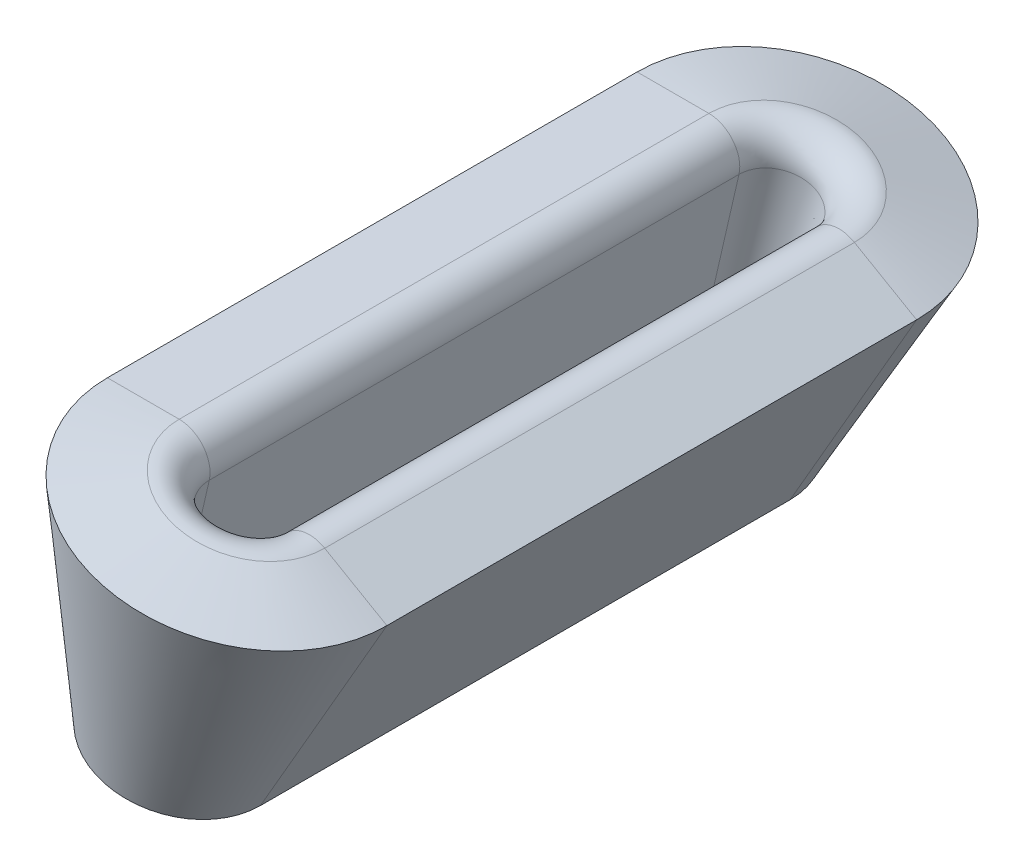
ISO-10303-21;
HEADER;
FILE_DESCRIPTION(('STEP AP214'),'2;1');
FILE_NAME('part.step','',(''),(''),'','','');
FILE_SCHEMA(('AUTOMOTIVE_DESIGN { 1 0 10303 214 1 1 1 1 }'));
ENDSEC;
DATA;
#1=APPLICATION_CONTEXT('core data for automotive mechanical design processes');
#2=APPLICATION_PROTOCOL_DEFINITION('international standard','automotive_design',2000,#1);
#3=PRODUCT_CONTEXT('',#1,'mechanical');
#4=PRODUCT('Part','Part','',(#3));
#5=PRODUCT_RELATED_PRODUCT_CATEGORY('part','',(#4));
#6=PRODUCT_DEFINITION_FORMATION('','',#4);
#7=PRODUCT_DEFINITION_CONTEXT('part definition',#1,'design');
#8=PRODUCT_DEFINITION('design','',#6,#7);
#9=PRODUCT_DEFINITION_SHAPE('','',#8);
#10=(LENGTH_UNIT() NAMED_UNIT(*) SI_UNIT(.MILLI.,.METRE.));
#11=(NAMED_UNIT(*) PLANE_ANGLE_UNIT() SI_UNIT($,.RADIAN.));
#12=(NAMED_UNIT(*) SI_UNIT($,.STERADIAN.) SOLID_ANGLE_UNIT());
#13=UNCERTAINTY_MEASURE_WITH_UNIT(LENGTH_MEASURE(1.E-05),#10,'distance_accuracy_value','');
#14=(GEOMETRIC_REPRESENTATION_CONTEXT(3) GLOBAL_UNCERTAINTY_ASSIGNED_CONTEXT((#13)) GLOBAL_UNIT_ASSIGNED_CONTEXT((#10,
#11,#12)) REPRESENTATION_CONTEXT('',''));
#15=CARTESIAN_POINT('',(0.,0.,0.));
#16=DIRECTION('',(0.,0.,1.));
#17=DIRECTION('',(1.,0.,0.));
#18=AXIS2_PLACEMENT_3D('',#15,#16,#17);
#19=CARTESIAN_POINT('',(13.5884499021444,51.8324006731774,0.));
#20=DIRECTION('',(0.258819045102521,0.965925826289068,0.));
#21=DIRECTION('',(-0.965925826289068,0.258819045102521,0.));
#22=AXIS2_PLACEMENT_3D('',#19,#20,#21);
#23=CONICAL_SURFACE('',#22,14.0677985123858,0.261799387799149);
#24=CARTESIAN_POINT('',(13.5884499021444,51.8324006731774,0.));
#25=DIRECTION('',(0.258819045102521,0.965925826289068,0.));
#26=DIRECTION('',(-0.965925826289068,0.258819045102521,0.));
#27=AXIS2_PLACEMENT_3D('',#24,#25,#26);
#28=CIRCLE('',#27,14.0677985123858);
#29=CARTESIAN_POINT('',(27.1768998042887,48.191386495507,0.));
#30=VERTEX_POINT('',#29);
#31=CARTESIAN_POINT('',(0.,55.4734148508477,0.));
#32=VERTEX_POINT('',#31);
#33=EDGE_CURVE('E11',#30,#32,#28,.T.);
#34=ORIENTED_EDGE('',*,*,#33,.F.);
#35=DIRECTION('',(-0.5,-0.866025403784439,0.));
#36=VECTOR('',#35,1.);
#37=CARTESIAN_POINT('',(14.8768998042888,26.8871615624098,0.));
#38=LINE('',#37,#36);
#39=CARTESIAN_POINT('',(14.8768998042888,26.8871615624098,0.));
#40=VERTEX_POINT('',#39);
#41=EDGE_CURVE('E196',#30,#40,#38,.T.);
#42=ORIENTED_EDGE('',*,*,#41,.T.);
#43=CARTESIAN_POINT('',(7.43844990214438,28.8802882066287,0.));
#44=DIRECTION('',(0.258819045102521,0.965925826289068,0.));
#45=DIRECTION('',(-0.965925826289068,0.258819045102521,0.));
#46=AXIS2_PLACEMENT_3D('',#43,#44,#45);
#47=CIRCLE('',#46,7.70085000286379);
#48=CARTESIAN_POINT('',(0.,30.8734148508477,0.));
#49=VERTEX_POINT('',#48);
#50=EDGE_CURVE('E214',#40,#49,#47,.T.);
#51=ORIENTED_EDGE('',*,*,#50,.T.);
#52=DIRECTION('',(0.,-1.,0.));
#53=VECTOR('',#52,1.);
#54=CARTESIAN_POINT('',(0.,30.8734148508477,0.));
#55=LINE('',#54,#53);
#56=EDGE_CURVE('E179',#32,#49,#55,.T.);
#57=ORIENTED_EDGE('',*,*,#56,.F.);
#58=EDGE_LOOP('',(#34,#42,#51,#57));
#59=FACE_BOUND('',#58,.T.);
#60=ADVANCED_FACE('F39',(#59),#23,.T.);
#61=CARTESIAN_POINT('',(14.0562132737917,53.5781173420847,0.));
#62=DIRECTION('',(-0.258819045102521,-0.965925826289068,0.));
#63=DIRECTION('',(0.965925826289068,-0.258819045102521,0.));
#64=AXIS2_PLACEMENT_3D('',#61,#62,#63);
#65=CONICAL_SURFACE('',#64,7.32286724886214,1.30899693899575);
#66=CARTESIAN_POINT('',(14.0562132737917,53.5781173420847,0.));
#67=DIRECTION('',(0.258819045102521,0.965925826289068,0.));
#68=DIRECTION('',(-0.965925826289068,0.258819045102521,0.));
#69=AXIS2_PLACEMENT_3D('',#66,#67,#68);
#70=CIRCLE('',#69,7.32286724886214);
#71=CARTESIAN_POINT('',(21.1295598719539,51.6828198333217,0.));
#72=VERTEX_POINT('',#71);
#73=CARTESIAN_POINT('',(6.98286667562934,55.4734148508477,0.));
#74=VERTEX_POINT('',#73);
#75=EDGE_CURVE('E48',#72,#74,#70,.T.);
#76=ORIENTED_EDGE('',*,*,#75,.F.);
#77=DIRECTION('',(0.866025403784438,-0.500000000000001,0.));
#78=VECTOR('',#77,1.);
#79=CARTESIAN_POINT('',(21.129559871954,51.6828198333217,0.));
#80=LINE('',#79,#78);
#81=EDGE_CURVE('E211',#72,#30,#80,.T.);
#82=ORIENTED_EDGE('',*,*,#81,.T.);
#83=ORIENTED_EDGE('',*,*,#33,.T.);
#84=DIRECTION('',(-1.,0.,0.));
#85=VECTOR('',#84,1.);
#86=CARTESIAN_POINT('',(6.98286667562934,55.4734148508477,0.));
#87=LINE('',#86,#85);
#88=EDGE_CURVE('E192',#74,#32,#87,.T.);
#89=ORIENTED_EDGE('',*,*,#88,.F.);
#90=EDGE_LOOP('',(#76,#82,#83,#89));
#91=FACE_BOUND('',#90,.T.);
#92=ADVANCED_FACE('F41',(#91),#65,.T.);
#93=CARTESIAN_POINT('',(13.3062132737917,50.779079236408,0.));
#94=DIRECTION('',(0.258819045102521,0.965925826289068,0.));
#95=DIRECTION('',(-0.965925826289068,0.258819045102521,0.));
#96=AXIS2_PLACEMENT_3D('',#93,#94,#95);
#97=TOROIDAL_SURFACE('',#96,6.54641011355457,3.00000000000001);
#98=CARTESIAN_POINT('',(13.3341906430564,50.8834921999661,0.));
#99=DIRECTION('',(0.258819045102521,0.965925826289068,0.));
#100=DIRECTION('',(-0.965925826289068,0.258819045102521,0.));
#101=AXIS2_PLACEMENT_3D('',#98,#99,#100);
#102=CIRCLE('',#101,3.54835821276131);
#103=CARTESIAN_POINT('',(16.7616414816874,49.9651095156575,0.));
#104=VERTEX_POINT('',#103);
#105=CARTESIAN_POINT('',(9.9067398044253,51.8018748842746,0.));
#106=VERTEX_POINT('',#105);
#107=EDGE_CURVE('E220',#104,#106,#102,.T.);
#108=ORIENTED_EDGE('',*,*,#107,.F.);
#109=CARTESIAN_POINT('',(19.629559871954,49.0847436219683,0.));
#110=DIRECTION('',(0.,0.,-1.));
#111=DIRECTION('',(0.866025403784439,-0.5,0.));
#112=AXIS2_PLACEMENT_3D('',#109,#110,#111);
#113=CIRCLE('',#112,3.00000000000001);
#114=EDGE_CURVE('E208',#104,#72,#113,.T.);
#115=ORIENTED_EDGE('',*,*,#114,.T.);
#116=ORIENTED_EDGE('',*,*,#75,.T.);
#117=CARTESIAN_POINT('',(6.98286667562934,52.4734148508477,0.));
#118=DIRECTION('',(0.,0.,1.));
#119=DIRECTION('',(-1.,0.,0.));
#120=AXIS2_PLACEMENT_3D('',#117,#118,#119);
#121=CIRCLE('',#120,3.00000000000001);
#122=EDGE_CURVE('E189',#106,#74,#121,.T.);
#123=ORIENTED_EDGE('',*,*,#122,.F.);
#124=EDGE_LOOP('',(#108,#115,#116,#123));
#125=FACE_BOUND('',#124,.T.);
#126=ADVANCED_FACE('F228',(#125),#97,.T.);
#127=CARTESIAN_POINT('',(7.78008512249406,30.1552882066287,0.));
#128=DIRECTION('',(0.258819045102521,0.965925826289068,0.));
#129=DIRECTION('',(-0.965925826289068,0.258819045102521,0.));
#130=AXIS2_PLACEMENT_3D('',#127,#128,#129);
#131=CONICAL_SURFACE('',#130,2.77462828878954,0.0360398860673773);
#132=CARTESIAN_POINT('',(7.78008512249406,30.1552882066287,0.));
#133=DIRECTION('',(0.258819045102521,0.965925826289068,0.));
#134=DIRECTION('',(-0.965925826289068,0.258819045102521,0.));
#135=AXIS2_PLACEMENT_3D('',#132,#133,#134);
#136=CIRCLE('',#135,2.77462828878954);
#137=CARTESIAN_POINT('',(10.4601702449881,29.4371615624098,0.));
#138=VERTEX_POINT('',#137);
#139=CARTESIAN_POINT('',(5.1,30.8734148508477,0.));
#140=VERTEX_POINT('',#139);
#141=EDGE_CURVE('E217',#138,#140,#136,.T.);
#142=ORIENTED_EDGE('',*,*,#141,.F.);
#143=DIRECTION('',(0.293455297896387,0.955972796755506,0.));
#144=VECTOR('',#143,1.);
#145=CARTESIAN_POINT('',(10.4601702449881,29.4371615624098,0.));
#146=LINE('',#145,#144);
#147=EDGE_CURVE('E204',#138,#104,#146,.T.);
#148=ORIENTED_EDGE('',*,*,#147,.T.);
#149=ORIENTED_EDGE('',*,*,#107,.T.);
#150=DIRECTION('',(0.223846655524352,0.974624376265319,0.));
#151=VECTOR('',#150,1.);
#152=CARTESIAN_POINT('',(5.1,30.8734148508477,0.));
#153=LINE('',#152,#151);
#154=EDGE_CURVE('E141',#140,#106,#153,.T.);
#155=ORIENTED_EDGE('',*,*,#154,.F.);
#156=EDGE_LOOP('',(#142,#148,#149,#155));
#157=FACE_BOUND('',#156,.T.);
#158=ADVANCED_FACE('F302',(#157),#131,.F.);
#159=CARTESIAN_POINT('',(7.43844990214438,28.8802882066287,0.));
#160=DIRECTION('',(-0.258819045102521,-0.965925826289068,0.));
#161=DIRECTION('',(0.965925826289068,-0.258819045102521,0.));
#162=AXIS2_PLACEMENT_3D('',#159,#160,#161);
#163=CONICAL_SURFACE('',#162,7.70085000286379,1.30899693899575);
#164=DIRECTION('',(-0.866025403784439,0.5,0.));
#165=VECTOR('',#164,1.);
#166=CARTESIAN_POINT('',(10.4601702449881,29.4371615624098,0.));
#167=LINE('',#166,#165);
#168=EDGE_CURVE('E200',#40,#138,#167,.T.);
#169=ORIENTED_EDGE('',*,*,#168,.T.);
#170=ORIENTED_EDGE('',*,*,#141,.T.);
#171=DIRECTION('',(1.,0.,0.));
#172=VECTOR('',#171,1.);
#173=CARTESIAN_POINT('',(5.1,30.8734148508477,0.));
#174=LINE('',#173,#172);
#175=EDGE_CURVE('E183',#49,#140,#174,.T.);
#176=ORIENTED_EDGE('',*,*,#175,.F.);
#177=ORIENTED_EDGE('',*,*,#50,.F.);
#178=EDGE_LOOP('',(#169,#170,#176,#177));
#179=FACE_BOUND('',#178,.T.);
#180=ADVANCED_FACE('F299',(#179),#163,.F.);
#181=CARTESIAN_POINT('',(6.98286667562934,52.4734148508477,51.5));
#182=DIRECTION('',(0.,0.,-1.));
#183=DIRECTION('',(-1.,0.,0.));
#184=AXIS2_PLACEMENT_3D('',#181,#182,#183);
#185=CYLINDRICAL_SURFACE('',#184,3.);
#186=ORIENTED_EDGE('',*,*,#122,.T.);
#187=DIRECTION('',(0.,0.,-1.));
#188=VECTOR('',#187,1.);
#189=CARTESIAN_POINT('',(6.98286667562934,55.4734148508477,51.5));
#190=LINE('',#189,#188);
#191=CARTESIAN_POINT('',(6.98286667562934,55.4734148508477,51.5));
#192=VERTEX_POINT('',#191);
#193=EDGE_CURVE('E122',#192,#74,#190,.T.);
#194=ORIENTED_EDGE('',*,*,#193,.F.);
#195=CARTESIAN_POINT('',(6.98286667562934,52.4734148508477,51.5));
#196=DIRECTION('',(0.,0.,1.));
#197=DIRECTION('',(1.,0.,0.));
#198=AXIS2_PLACEMENT_3D('',#195,#196,#197);
#199=CIRCLE('',#198,3.);
#200=CARTESIAN_POINT('',(9.9067398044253,51.8018748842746,51.5));
#201=VERTEX_POINT('',#200);
#202=EDGE_CURVE('E117',#201,#192,#199,.T.);
#203=ORIENTED_EDGE('',*,*,#202,.F.);
#204=DIRECTION('',(0.,0.,-1.));
#205=VECTOR('',#204,1.);
#206=CARTESIAN_POINT('',(9.9067398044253,51.8018748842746,51.5));
#207=LINE('',#206,#205);
#208=EDGE_CURVE('E120',#201,#106,#207,.T.);
#209=ORIENTED_EDGE('',*,*,#208,.T.);
#210=EDGE_LOOP('',(#186,#194,#203,#209));
#211=FACE_BOUND('',#210,.T.);
#212=ADVANCED_FACE('F119',(#211),#185,.T.);
#213=CARTESIAN_POINT('',(6.98286667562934,55.4734148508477,51.5));
#214=DIRECTION('',(0.,-1.,0.));
#215=DIRECTION('',(1.,0.,0.));
#216=AXIS2_PLACEMENT_3D('',#213,#214,#215);
#217=PLANE('',#216);
#218=ORIENTED_EDGE('',*,*,#88,.T.);
#219=DIRECTION('',(0.,0.,-1.));
#220=VECTOR('',#219,1.);
#221=CARTESIAN_POINT('',(0.,55.4734148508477,51.5));
#222=LINE('',#221,#220);
#223=CARTESIAN_POINT('',(0.,55.4734148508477,51.5));
#224=VERTEX_POINT('',#223);
#225=EDGE_CURVE('E173',#224,#32,#222,.T.);
#226=ORIENTED_EDGE('',*,*,#225,.F.);
#227=DIRECTION('',(-1.,0.,0.));
#228=VECTOR('',#227,1.);
#229=CARTESIAN_POINT('',(6.98286667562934,55.4734148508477,51.5));
#230=LINE('',#229,#228);
#231=EDGE_CURVE('E129',#192,#224,#230,.T.);
#232=ORIENTED_EDGE('',*,*,#231,.F.);
#233=ORIENTED_EDGE('',*,*,#193,.T.);
#234=EDGE_LOOP('',(#218,#226,#232,#233));
#235=FACE_BOUND('',#234,.T.);
#236=ADVANCED_FACE('F231',(#235),#217,.F.);
#237=CARTESIAN_POINT('',(0.,55.4734148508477,51.5));
#238=DIRECTION('',(1.,0.,0.));
#239=DIRECTION('',(0.,0.,-1.));
#240=AXIS2_PLACEMENT_3D('',#237,#238,#239);
#241=PLANE('',#240);
#242=ORIENTED_EDGE('',*,*,#56,.T.);
#243=DIRECTION('',(0.,0.,-1.));
#244=VECTOR('',#243,1.);
#245=CARTESIAN_POINT('',(0.,30.8734148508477,51.5));
#246=LINE('',#245,#244);
#247=CARTESIAN_POINT('',(0.,30.8734148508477,51.5));
#248=VERTEX_POINT('',#247);
#249=EDGE_CURVE('E169',#248,#49,#246,.T.);
#250=ORIENTED_EDGE('',*,*,#249,.F.);
#251=DIRECTION('',(0.,-1.,0.));
#252=VECTOR('',#251,1.);
#253=CARTESIAN_POINT('',(0.,55.4734148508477,51.5));
#254=LINE('',#253,#252);
#255=EDGE_CURVE('E163',#224,#248,#254,.T.);
#256=ORIENTED_EDGE('',*,*,#255,.F.);
#257=ORIENTED_EDGE('',*,*,#225,.T.);
#258=EDGE_LOOP('',(#242,#250,#256,#257));
#259=FACE_BOUND('',#258,.T.);
#260=ADVANCED_FACE('F293',(#259),#241,.F.);
#261=CARTESIAN_POINT('',(0.,30.8734148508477,51.5));
#262=DIRECTION('',(0.,1.,0.));
#263=DIRECTION('',(0.,0.,1.));
#264=AXIS2_PLACEMENT_3D('',#261,#262,#263);
#265=PLANE('',#264);
#266=ORIENTED_EDGE('',*,*,#175,.T.);
#267=DIRECTION('',(0.,0.,-1.));
#268=VECTOR('',#267,1.);
#269=CARTESIAN_POINT('',(5.1,30.8734148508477,51.5));
#270=LINE('',#269,#268);
#271=CARTESIAN_POINT('',(5.1,30.8734148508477,51.5));
#272=VERTEX_POINT('',#271);
#273=EDGE_CURVE('E143',#272,#140,#270,.T.);
#274=ORIENTED_EDGE('',*,*,#273,.F.);
#275=DIRECTION('',(1.,0.,0.));
#276=VECTOR('',#275,1.);
#277=CARTESIAN_POINT('',(0.,30.8734148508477,51.5));
#278=LINE('',#277,#276);
#279=EDGE_CURVE('E160',#248,#272,#278,.T.);
#280=ORIENTED_EDGE('',*,*,#279,.F.);
#281=ORIENTED_EDGE('',*,*,#249,.T.);
#282=EDGE_LOOP('',(#266,#274,#280,#281));
#283=FACE_BOUND('',#282,.T.);
#284=ADVANCED_FACE('F295',(#283),#265,.F.);
#285=CARTESIAN_POINT('',(5.1,30.8734148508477,51.5));
#286=DIRECTION('',(-0.974624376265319,0.223846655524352,0.));
#287=DIRECTION('',(-0.223846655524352,-0.974624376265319,0.));
#288=AXIS2_PLACEMENT_3D('',#285,#286,#287);
#289=PLANE('',#288);
#290=ORIENTED_EDGE('',*,*,#154,.T.);
#291=ORIENTED_EDGE('',*,*,#208,.F.);
#292=DIRECTION('',(0.223846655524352,0.974624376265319,0.));
#293=VECTOR('',#292,1.);
#294=CARTESIAN_POINT('',(5.1,30.8734148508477,51.5));
#295=LINE('',#294,#293);
#296=EDGE_CURVE('E138',#272,#201,#295,.T.);
#297=ORIENTED_EDGE('',*,*,#296,.F.);
#298=ORIENTED_EDGE('',*,*,#273,.T.);
#299=EDGE_LOOP('',(#290,#291,#297,#298));
#300=FACE_BOUND('',#299,.T.);
#301=ADVANCED_FACE('F135',(#300),#289,.F.);
#302=CARTESIAN_POINT('',(27.1768998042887,48.191386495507,51.5));
#303=DIRECTION('',(-0.86602540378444,0.499999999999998,0.));
#304=DIRECTION('',(-0.499999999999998,-0.86602540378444,0.));
#305=AXIS2_PLACEMENT_3D('',#302,#303,#304);
#306=PLANE('',#305);
#307=ORIENTED_EDGE('',*,*,#41,.F.);
#308=DIRECTION('',(0.,0.,-1.));
#309=VECTOR('',#308,1.);
#310=CARTESIAN_POINT('',(27.1768998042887,48.191386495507,51.5));
#311=LINE('',#310,#309);
#312=CARTESIAN_POINT('',(27.1768998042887,48.191386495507,51.5));
#313=VERTEX_POINT('',#312);
#314=EDGE_CURVE('E130',#313,#30,#311,.T.);
#315=ORIENTED_EDGE('',*,*,#314,.F.);
#316=DIRECTION('',(0.499999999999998,0.86602540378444,0.));
#317=VECTOR('',#316,1.);
#318=CARTESIAN_POINT('',(27.1768998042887,48.191386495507,51.5));
#319=LINE('',#318,#317);
#320=CARTESIAN_POINT('',(14.8768998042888,26.8871615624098,51.5));
#321=VERTEX_POINT('',#320);
#322=EDGE_CURVE('E270',#321,#313,#319,.T.);
#323=ORIENTED_EDGE('',*,*,#322,.F.);
#324=DIRECTION('',(0.,0.,-1.));
#325=VECTOR('',#324,1.);
#326=CARTESIAN_POINT('',(14.8768998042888,26.8871615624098,51.5));
#327=LINE('',#326,#325);
#328=EDGE_CURVE('E253',#321,#40,#327,.T.);
#329=ORIENTED_EDGE('',*,*,#328,.T.);
#330=EDGE_LOOP('',(#307,#315,#323,#329));
#331=FACE_BOUND('',#330,.T.);
#332=ADVANCED_FACE('F314',(#331),#306,.F.);
#333=CARTESIAN_POINT('',(21.1295598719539,51.6828198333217,51.5));
#334=DIRECTION('',(-0.499999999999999,-0.866025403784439,0.));
#335=DIRECTION('',(0.866025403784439,-0.499999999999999,0.));
#336=AXIS2_PLACEMENT_3D('',#333,#334,#335);
#337=PLANE('',#336);
#338=ORIENTED_EDGE('',*,*,#81,.F.);
#339=DIRECTION('',(0.,0.,-1.));
#340=VECTOR('',#339,1.);
#341=CARTESIAN_POINT('',(21.1295598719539,51.6828198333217,51.5));
#342=LINE('',#341,#340);
#343=CARTESIAN_POINT('',(21.1295598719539,51.6828198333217,51.5));
#344=VERTEX_POINT('',#343);
#345=EDGE_CURVE('E243',#344,#72,#342,.T.);
#346=ORIENTED_EDGE('',*,*,#345,.F.);
#347=DIRECTION('',(-0.866025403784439,0.499999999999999,0.));
#348=VECTOR('',#347,1.);
#349=CARTESIAN_POINT('',(21.1295598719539,51.6828198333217,51.5));
#350=LINE('',#349,#348);
#351=EDGE_CURVE('E266',#313,#344,#350,.T.);
#352=ORIENTED_EDGE('',*,*,#351,.F.);
#353=ORIENTED_EDGE('',*,*,#314,.T.);
#354=EDGE_LOOP('',(#338,#346,#352,#353));
#355=FACE_BOUND('',#354,.T.);
#356=ADVANCED_FACE('F309',(#355),#337,.F.);
#357=CARTESIAN_POINT('',(19.6295598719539,49.0847436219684,51.5));
#358=DIRECTION('',(0.,0.,-1.));
#359=DIRECTION('',(-1.,0.,0.));
#360=AXIS2_PLACEMENT_3D('',#357,#358,#359);
#361=CYLINDRICAL_SURFACE('',#360,2.99999999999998);
#362=ORIENTED_EDGE('',*,*,#345,.T.);
#363=ORIENTED_EDGE('',*,*,#114,.F.);
#364=DIRECTION('',(0.,0.,-1.));
#365=VECTOR('',#364,1.);
#366=CARTESIAN_POINT('',(16.7616414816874,49.9651095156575,51.5));
#367=LINE('',#366,#365);
#368=CARTESIAN_POINT('',(16.7616414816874,49.9651095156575,51.5));
#369=VERTEX_POINT('',#368);
#370=EDGE_CURVE('E247',#369,#104,#367,.T.);
#371=ORIENTED_EDGE('',*,*,#370,.F.);
#372=CARTESIAN_POINT('',(19.6295598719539,49.0847436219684,51.5));
#373=DIRECTION('',(0.,0.,1.));
#374=DIRECTION('',(-1.,0.,0.));
#375=AXIS2_PLACEMENT_3D('',#372,#373,#374);
#376=CIRCLE('',#375,2.99999999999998);
#377=EDGE_CURVE('E149',#344,#369,#376,.T.);
#378=ORIENTED_EDGE('',*,*,#377,.F.);
#379=EDGE_LOOP('',(#362,#363,#371,#378));
#380=FACE_BOUND('',#379,.T.);
#381=ADVANCED_FACE('F307',(#380),#361,.T.);
#382=CARTESIAN_POINT('',(10.4601702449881,29.4371615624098,51.5));
#383=DIRECTION('',(0.955972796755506,-0.293455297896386,0.));
#384=DIRECTION('',(0.293455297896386,0.955972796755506,0.));
#385=AXIS2_PLACEMENT_3D('',#382,#383,#384);
#386=PLANE('',#385);
#387=ORIENTED_EDGE('',*,*,#147,.F.);
#388=DIRECTION('',(0.,0.,-1.));
#389=VECTOR('',#388,1.);
#390=CARTESIAN_POINT('',(10.4601702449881,29.4371615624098,51.5));
#391=LINE('',#390,#389);
#392=CARTESIAN_POINT('',(10.4601702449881,29.4371615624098,51.5));
#393=VERTEX_POINT('',#392);
#394=EDGE_CURVE('E55',#393,#138,#391,.T.);
#395=ORIENTED_EDGE('',*,*,#394,.F.);
#396=DIRECTION('',(-0.293455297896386,-0.955972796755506,0.));
#397=VECTOR('',#396,1.);
#398=CARTESIAN_POINT('',(10.4601702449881,29.4371615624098,51.5));
#399=LINE('',#398,#397);
#400=EDGE_CURVE('E261',#369,#393,#399,.T.);
#401=ORIENTED_EDGE('',*,*,#400,.F.);
#402=ORIENTED_EDGE('',*,*,#370,.T.);
#403=EDGE_LOOP('',(#387,#395,#401,#402));
#404=FACE_BOUND('',#403,.T.);
#405=ADVANCED_FACE('F304',(#404),#386,.F.);
#406=CARTESIAN_POINT('',(14.8768998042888,26.8871615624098,51.5));
#407=DIRECTION('',(0.499999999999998,0.866025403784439,0.));
#408=DIRECTION('',(-0.86602540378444,0.499999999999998,0.));
#409=AXIS2_PLACEMENT_3D('',#406,#407,#408);
#410=PLANE('',#409);
#411=ORIENTED_EDGE('',*,*,#168,.F.);
#412=ORIENTED_EDGE('',*,*,#328,.F.);
#413=DIRECTION('',(0.86602540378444,-0.499999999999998,0.));
#414=VECTOR('',#413,1.);
#415=CARTESIAN_POINT('',(14.8768998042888,26.8871615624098,51.5));
#416=LINE('',#415,#414);
#417=EDGE_CURVE('E257',#393,#321,#416,.T.);
#418=ORIENTED_EDGE('',*,*,#417,.F.);
#419=ORIENTED_EDGE('',*,*,#394,.T.);
#420=EDGE_LOOP('',(#411,#412,#418,#419));
#421=FACE_BOUND('',#420,.T.);
#422=ADVANCED_FACE('F392',(#421),#410,.F.);
#423=CARTESIAN_POINT('',(13.3062132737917,50.779079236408,51.5));
#424=DIRECTION('',(-0.258819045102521,-0.965925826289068,0.));
#425=DIRECTION('',(0.965925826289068,-0.258819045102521,0.));
#426=AXIS2_PLACEMENT_3D('',#423,#424,#425);
#427=TOROIDAL_SURFACE('',#426,6.54641011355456,3.);
#428=CARTESIAN_POINT('',(14.0562132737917,53.5781173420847,51.5));
#429=DIRECTION('',(-0.258819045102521,-0.965925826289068,0.));
#430=DIRECTION('',(0.965925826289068,-0.258819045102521,0.));
#431=AXIS2_PLACEMENT_3D('',#428,#429,#430);
#432=CIRCLE('',#431,7.32286724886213);
#433=EDGE_CURVE('E274',#344,#192,#432,.T.);
#434=ORIENTED_EDGE('',*,*,#433,.F.);
#435=ORIENTED_EDGE('',*,*,#377,.T.);
#436=CARTESIAN_POINT('',(13.3341906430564,50.8834921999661,51.5));
#437=DIRECTION('',(-0.258819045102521,-0.965925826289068,0.));
#438=DIRECTION('',(0.965925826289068,-0.258819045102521,0.));
#439=AXIS2_PLACEMENT_3D('',#436,#437,#438);
#440=CIRCLE('',#439,3.54835821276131);
#441=EDGE_CURVE('E146',#369,#201,#440,.T.);
#442=ORIENTED_EDGE('',*,*,#441,.T.);
#443=ORIENTED_EDGE('',*,*,#202,.T.);
#444=EDGE_LOOP('',(#434,#435,#442,#443));
#445=FACE_BOUND('',#444,.T.);
#446=ADVANCED_FACE('F147',(#445),#427,.T.);
#447=CARTESIAN_POINT('',(14.0562132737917,53.5781173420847,51.5));
#448=DIRECTION('',(-0.258819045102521,-0.965925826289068,0.));
#449=DIRECTION('',(0.965925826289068,-0.258819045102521,0.));
#450=AXIS2_PLACEMENT_3D('',#447,#448,#449);
#451=CONICAL_SURFACE('',#450,7.32286724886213,1.30899693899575);
#452=CARTESIAN_POINT('',(13.5884499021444,51.8324006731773,51.5));
#453=DIRECTION('',(-0.258819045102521,-0.965925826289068,0.));
#454=DIRECTION('',(0.965925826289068,-0.258819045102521,0.));
#455=AXIS2_PLACEMENT_3D('',#452,#453,#454);
#456=CIRCLE('',#455,14.0677985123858);
#457=EDGE_CURVE('E277',#313,#224,#456,.T.);
#458=ORIENTED_EDGE('',*,*,#457,.F.);
#459=ORIENTED_EDGE('',*,*,#351,.T.);
#460=ORIENTED_EDGE('',*,*,#433,.T.);
#461=ORIENTED_EDGE('',*,*,#231,.T.);
#462=EDGE_LOOP('',(#458,#459,#460,#461));
#463=FACE_BOUND('',#462,.T.);
#464=ADVANCED_FACE('F405',(#463),#451,.T.);
#465=CARTESIAN_POINT('',(13.5884499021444,51.8324006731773,51.5));
#466=DIRECTION('',(0.258819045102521,0.965925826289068,0.));
#467=DIRECTION('',(-0.965925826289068,0.258819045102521,0.));
#468=AXIS2_PLACEMENT_3D('',#465,#466,#467);
#469=CONICAL_SURFACE('',#468,14.0677985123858,0.261799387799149);
#470=CARTESIAN_POINT('',(7.43844990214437,28.8802882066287,51.5));
#471=DIRECTION('',(-0.258819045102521,-0.965925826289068,0.));
#472=DIRECTION('',(0.965925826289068,-0.258819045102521,0.));
#473=AXIS2_PLACEMENT_3D('',#470,#471,#472);
#474=CIRCLE('',#473,7.70085000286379);
#475=EDGE_CURVE('E281',#321,#248,#474,.T.);
#476=ORIENTED_EDGE('',*,*,#475,.F.);
#477=ORIENTED_EDGE('',*,*,#322,.T.);
#478=ORIENTED_EDGE('',*,*,#457,.T.);
#479=ORIENTED_EDGE('',*,*,#255,.T.);
#480=EDGE_LOOP('',(#476,#477,#478,#479));
#481=FACE_BOUND('',#480,.T.);
#482=ADVANCED_FACE('F291',(#481),#469,.T.);
#483=CARTESIAN_POINT('',(7.43844990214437,28.8802882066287,51.5));
#484=DIRECTION('',(-0.258819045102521,-0.965925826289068,0.));
#485=DIRECTION('',(0.965925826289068,-0.258819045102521,0.));
#486=AXIS2_PLACEMENT_3D('',#483,#484,#485);
#487=CONICAL_SURFACE('',#486,7.70085000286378,1.30899693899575);
#488=CARTESIAN_POINT('',(7.78008512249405,30.1552882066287,51.5));
#489=DIRECTION('',(-0.258819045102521,-0.965925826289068,0.));
#490=DIRECTION('',(0.965925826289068,-0.258819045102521,0.));
#491=AXIS2_PLACEMENT_3D('',#488,#489,#490);
#492=CIRCLE('',#491,2.77462828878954);
#493=EDGE_CURVE('E154',#393,#272,#492,.T.);
#494=ORIENTED_EDGE('',*,*,#493,.F.);
#495=ORIENTED_EDGE('',*,*,#417,.T.);
#496=ORIENTED_EDGE('',*,*,#475,.T.);
#497=ORIENTED_EDGE('',*,*,#279,.T.);
#498=EDGE_LOOP('',(#494,#495,#496,#497));
#499=FACE_BOUND('',#498,.T.);
#500=ADVANCED_FACE('F288',(#499),#487,.F.);
#501=CARTESIAN_POINT('',(7.78008512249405,30.1552882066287,51.5));
#502=DIRECTION('',(0.258819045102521,0.965925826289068,0.));
#503=DIRECTION('',(-0.965925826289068,0.258819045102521,0.));
#504=AXIS2_PLACEMENT_3D('',#501,#502,#503);
#505=CONICAL_SURFACE('',#504,2.77462828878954,0.0360398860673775);
#506=ORIENTED_EDGE('',*,*,#400,.T.);
#507=ORIENTED_EDGE('',*,*,#493,.T.);
#508=ORIENTED_EDGE('',*,*,#296,.T.);
#509=ORIENTED_EDGE('',*,*,#441,.F.);
#510=EDGE_LOOP('',(#506,#507,#508,#509));
#511=FACE_BOUND('',#510,.T.);
#512=ADVANCED_FACE('F156',(#511),#505,.F.);
#513=CLOSED_SHELL('',(#60,#92,#126,#158,#180,#212,#236,#260,#284,#301,#332,#356,#381,#405,#422,
#446,#464,#482,#500,#512));
#514=MANIFOLD_SOLID_BREP('B2',#513);
#515=ADVANCED_BREP_SHAPE_REPRESENTATION('',(#18,#514),#14);
#516=SHAPE_DEFINITION_REPRESENTATION(#9,#515);
ENDSEC;
END-ISO-10303-21;
